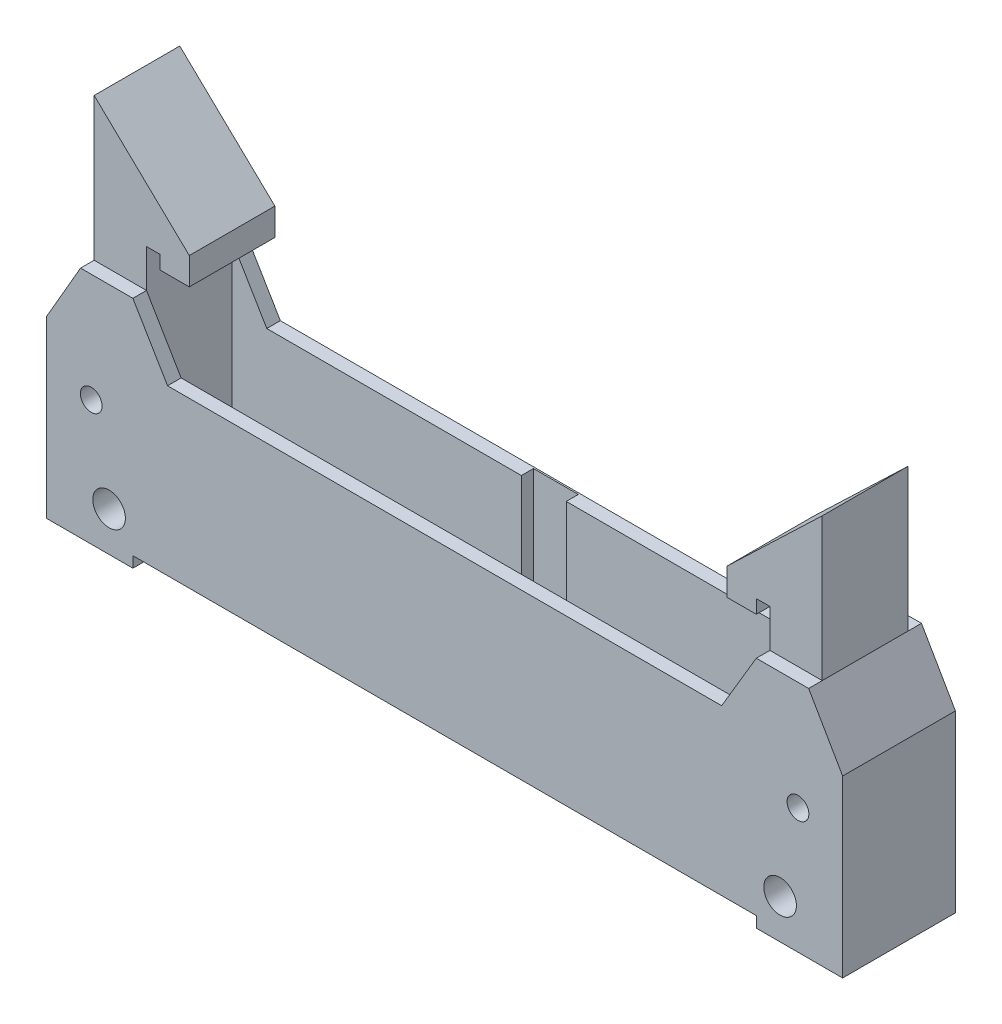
from build123d import *

# Parameters (mm, degrees)
EXTRUDE1_DEPTH             = 4.15
CUT_EXTRUDE1_DEPTH         = 6.1
CUT_EXTRUDE1_DEPTH_BACK    = 11.1
SKETCH2_W                  = 45.87
SKETCH2_H                  = 6.3
F_2_4_2_4_DIAMETER_HOLE1_D = 2.4
SKETCH6_W                  = 3.302
SKETCH6_H                  = 1.143
CUT_EXTRUDE2_DEPTH         = 11.1
SKETCH7_W                  = 61.259032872
SKETCH7_H                  = 1
SKETCH7_W_2                = 62.319795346
CUT_EXTRUDE3_DEPTH         = 10.5
SKETCH8_R                  = 0.8
CUT_EXTRUDE4_DEPTH         = 42.155694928


with BuildPart() as part:
    # Sketch1 → Extrude1 (new, symmetric)
    with BuildSketch(Plane.XY):
        Polygon((-29.285, 12.869872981), (-26.785, 17.2), (-26.785, 27.7), (-19.785, 21), (-19.785, 19), (-21.935, 19), (-21.935, 20), (-22.935, 20), (-22.935, 17.2), (-20.383529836, 12.9), (0, 12.9), (20.383529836, 12.9), (22.935, 17.2), (22.935, 20), (21.935, 20), (21.935, 19), (19.785, 19), (19.785, 21), (26.785, 27.7), (26.785, 17.2), (29.285, 12.869872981), (29.285, 0), (22.935, 0), (22.935, 0.8), (-22.935, 0.8), (-22.935, 0), (-29.285, 0), align=None)
    extrude(amount=EXTRUDE1_DEPTH, both=True)

    # Sketch2 → Cut-Extrude1 (cut, two sides: drawn at the far end of the back side and taken through both)
    with BuildSketch(Plane(origin=(0, 12.9, 0), x_dir=(-1, 0, 0), z_dir=(0, 1, 0)).offset(-CUT_EXTRUDE1_DEPTH_BACK)):
        Rectangle(SKETCH2_W, SKETCH2_H)
    extrude(amount=CUT_EXTRUDE1_DEPTH + CUT_EXTRUDE1_DEPTH_BACK, mode=Mode.SUBTRACT)

    # 2.4 _2.4_ Diameter Hole1 (through all)
    with Locations(Plane.XY.offset(4.15)):
        with Locations((-24.685, 2.905), (24.685, 2.905)):
            Hole(F_2_4_2_4_DIAMETER_HOLE1_D / 2)

    # Sketch6 → Cut-Extrude2 (cut)
    with BuildSketch(Plane(origin=(0, 12.9, 0), x_dir=(-1, 0, 0), z_dir=(0, 1, 0))):
        with Locations((0, -3.4675)):
            Rectangle(SKETCH6_W, SKETCH6_H)
    extrude(amount=-CUT_EXTRUDE2_DEPTH, mode=Mode.SUBTRACT)

    # Sketch7 → Cut-Extrude3 (cut)
    with BuildSketch(Plane(origin=(0, 27.7, 0), x_dir=(-1, 0, 0), z_dir=(0, 1, 0))):
        with Locations((-0.318228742, -3.65)):
            Rectangle(SKETCH7_W, SKETCH7_H)
        with Locations((0.212152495, 3.65)):
            Rectangle(SKETCH7_W_2, SKETCH7_H)
    extrude(amount=-CUT_EXTRUDE3_DEPTH, mode=Mode.SUBTRACT)

    # Sketch8 → Cut-Extrude4 (cut, through all)
    with BuildSketch(Plane.XY.offset(4.15)):
        with Locations((26, 9.2)):
            Circle(SKETCH8_R)
        with Locations((-26, 9.2)):
            Circle(SKETCH8_R)
    extrude(amount=-CUT_EXTRUDE4_DEPTH, mode=Mode.SUBTRACT)


solid = part.part
